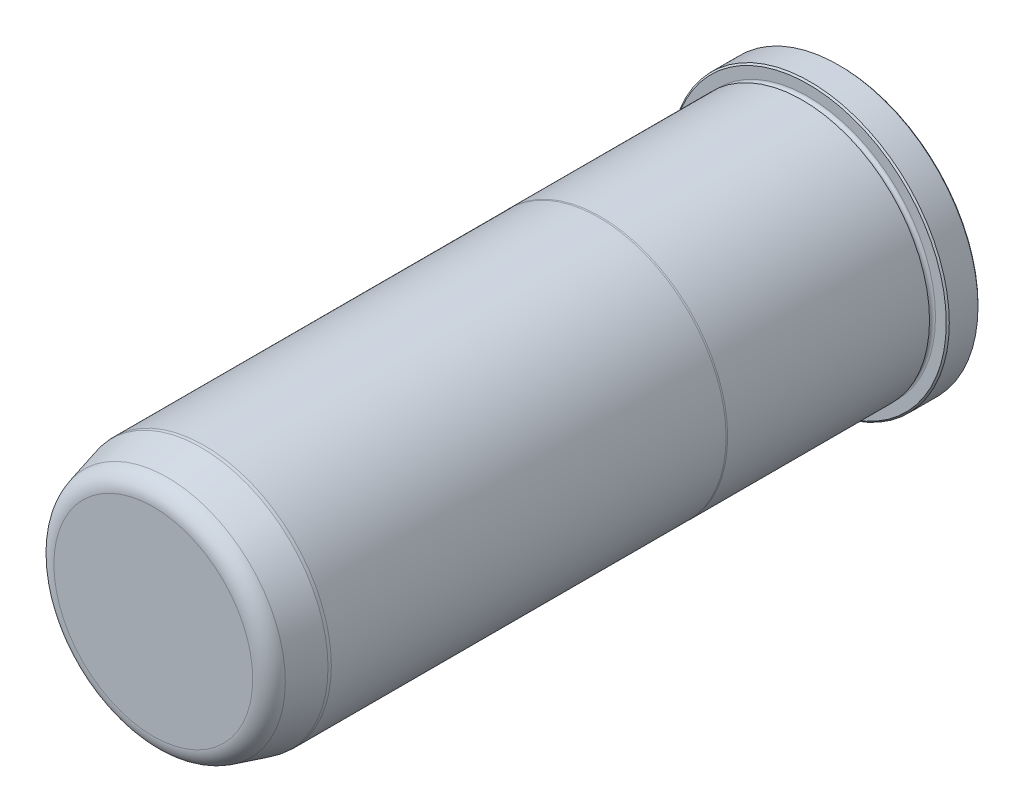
from build123d import *

# Parameters (mm, degrees)
FILLET6_R     = 4.7625
CHAMFER1_SIZE = 0.381


with BuildPart() as part:
    # Sketch1 → Revolve1 (revolve)
    with BuildSketch(Plane(origin=(0, 0, 0), x_dir=(0, 0, -1), z_dir=(1, 0, 0)), mode=Mode.PRIVATE) as revolve1_sk:
        with BuildLine():
            Line((0, 0), (0, 34.798))
            Line((0, 34.798), (-7.9248, 34.798))
            Line((-7.9248, 34.798), (-7.9248, 31.7373))
            ThreePointArc((-7.9248, 31.7373), (-8.6868, 30.9753), (-9.4488, 31.7373))
            Line((-9.4488, 31.7373), (-9.4488, 31.7627))
            Line((-9.4488, 31.7627), (-59.834763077, 31.7627))
            Line((-59.834763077, 31.7627), (-60.198, 31.7373))
            Line((-60.198, 31.7373), (-158.75, 31.7373))
            Line((-158.75, 31.7373), (-159.512, 31.670633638))
            Line((-159.512, 31.670633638), (-171.45, 28.471856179))
            Line((-171.45, 28.471856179), (-171.45, 0))
            Line((-171.45, 0), (0, 0))
        make_face()
    revolve(revolve1_sk.sketch.rotate(Axis((0, 0, 0), (0, 0, -1)), 90), axis=Axis((0, 0, 0), (0, 0, -1)))

    # Fillet6
    fillet6_edges = [part.edges().sort_by_distance(p)[0] for p in [
        (-28.471856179, 0, 171.45),
    ]]
    fillet(fillet6_edges, radius=FILLET6_R)

    # Chamfer1
    chamfer1_edges = [part.edges().sort_by_distance(p)[0] for p in [
        (-34.798, 0, 7.9248),
        (-34.798, 0, 0),
    ]]
    chamfer(chamfer1_edges, length=CHAMFER1_SIZE)


solid = part.part
